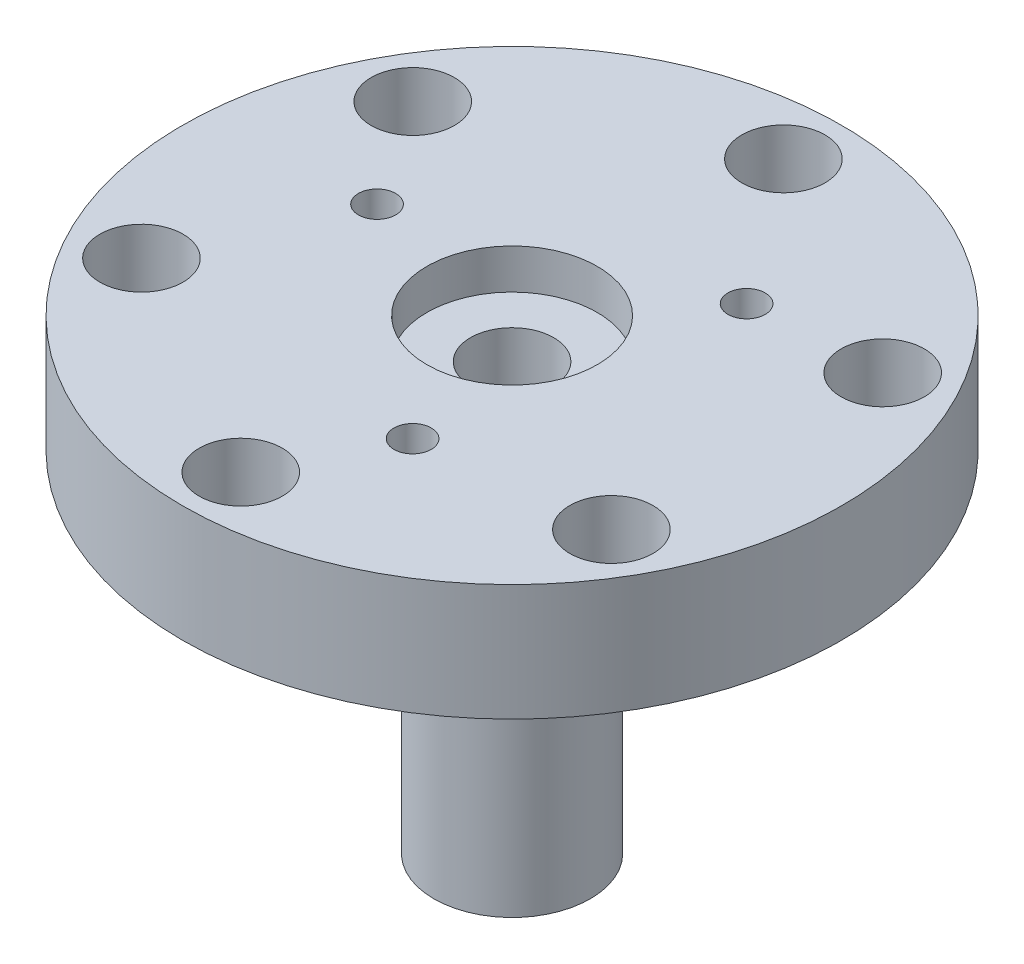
ISO-10303-21;
HEADER;
FILE_DESCRIPTION(('STEP AP214'),'2;1');
FILE_NAME('part.step','',(''),(''),'','','');
FILE_SCHEMA(('AUTOMOTIVE_DESIGN { 1 0 10303 214 1 1 1 1 }'));
ENDSEC;
DATA;
#1=APPLICATION_CONTEXT('core data for automotive mechanical design processes');
#2=APPLICATION_PROTOCOL_DEFINITION('international standard','automotive_design',2000,#1);
#3=PRODUCT_CONTEXT('',#1,'mechanical');
#4=PRODUCT('Part','Part','',(#3));
#5=PRODUCT_RELATED_PRODUCT_CATEGORY('part','',(#4));
#6=PRODUCT_DEFINITION_FORMATION('','',#4);
#7=PRODUCT_DEFINITION_CONTEXT('part definition',#1,'design');
#8=PRODUCT_DEFINITION('design','',#6,#7);
#9=PRODUCT_DEFINITION_SHAPE('','',#8);
#10=(LENGTH_UNIT() NAMED_UNIT(*) SI_UNIT(.MILLI.,.METRE.));
#11=(NAMED_UNIT(*) PLANE_ANGLE_UNIT() SI_UNIT($,.RADIAN.));
#12=(NAMED_UNIT(*) SI_UNIT($,.STERADIAN.) SOLID_ANGLE_UNIT());
#13=UNCERTAINTY_MEASURE_WITH_UNIT(LENGTH_MEASURE(1.E-05),#10,'distance_accuracy_value','');
#14=(GEOMETRIC_REPRESENTATION_CONTEXT(3) GLOBAL_UNCERTAINTY_ASSIGNED_CONTEXT((#13)) GLOBAL_UNIT_ASSIGNED_CONTEXT((#10,
#11,#12)) REPRESENTATION_CONTEXT('',''));
#15=CARTESIAN_POINT('',(0.,0.,0.));
#16=DIRECTION('',(0.,0.,1.));
#17=DIRECTION('',(1.,0.,0.));
#18=AXIS2_PLACEMENT_3D('',#15,#16,#17);
#19=CARTESIAN_POINT('',(17.9275918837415,-35.56,10.3505000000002));
#20=DIRECTION('',(0.,1.,0.));
#21=DIRECTION('',(0.,0.,1.));
#22=AXIS2_PLACEMENT_3D('',#19,#20,#21);
#23=CYLINDRICAL_SURFACE('',#22,1.7272);
#24=CARTESIAN_POINT('',(17.9275918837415,-8.89,10.3505000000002));
#25=DIRECTION('',(0.,-1.,0.));
#26=DIRECTION('',(0.,0.,-1.));
#27=AXIS2_PLACEMENT_3D('',#24,#25,#26);
#28=CIRCLE('',#27,1.7272);
#29=CARTESIAN_POINT('',(17.9275918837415,-8.89,8.62330000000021));
#30=VERTEX_POINT('',#29);
#31=EDGE_CURVE('E57',#30,#30,#28,.T.);
#32=ORIENTED_EDGE('',*,*,#31,.T.);
#33=EDGE_LOOP('',(#32));
#34=FACE_BOUND('',#33,.T.);
#35=CARTESIAN_POINT('',(17.9275918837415,-5.842,10.3505000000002));
#36=DIRECTION('',(0.,1.,0.));
#37=DIRECTION('',(0.,0.,1.));
#38=AXIS2_PLACEMENT_3D('',#35,#36,#37);
#39=CIRCLE('',#38,1.7272);
#40=CARTESIAN_POINT('',(17.9275918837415,-5.842,12.0777000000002));
#41=VERTEX_POINT('',#40);
#42=EDGE_CURVE('E74',#41,#41,#39,.F.);
#43=ORIENTED_EDGE('',*,*,#42,.F.);
#44=EDGE_LOOP('',(#43));
#45=FACE_BOUND('',#44,.T.);
#46=ADVANCED_FACE('F32',(#34,#45),#23,.F.);
#47=CARTESIAN_POINT('',(17.9275918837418,-35.56,-10.3504999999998));
#48=DIRECTION('',(0.,1.,0.));
#49=DIRECTION('',(0.,0.,1.));
#50=AXIS2_PLACEMENT_3D('',#47,#48,#49);
#51=CYLINDRICAL_SURFACE('',#50,1.7272);
#52=CARTESIAN_POINT('',(17.9275918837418,-8.89,-10.3504999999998));
#53=DIRECTION('',(0.,-1.,0.));
#54=DIRECTION('',(0.,0.,-1.));
#55=AXIS2_PLACEMENT_3D('',#52,#53,#54);
#56=CIRCLE('',#55,1.7272);
#57=CARTESIAN_POINT('',(17.9275918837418,-8.89,-12.0776999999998));
#58=VERTEX_POINT('',#57);
#59=EDGE_CURVE('E133',#58,#58,#56,.T.);
#60=ORIENTED_EDGE('',*,*,#59,.T.);
#61=EDGE_LOOP('',(#60));
#62=FACE_BOUND('',#61,.T.);
#63=CARTESIAN_POINT('',(17.9275918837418,-5.842,-10.3504999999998));
#64=DIRECTION('',(0.,1.,0.));
#65=DIRECTION('',(0.,0.,1.));
#66=AXIS2_PLACEMENT_3D('',#63,#64,#65);
#67=CIRCLE('',#66,1.7272);
#68=CARTESIAN_POINT('',(17.9275918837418,-5.842,-8.62329999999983));
#69=VERTEX_POINT('',#68);
#70=EDGE_CURVE('E69',#69,#69,#67,.F.);
#71=ORIENTED_EDGE('',*,*,#70,.F.);
#72=EDGE_LOOP('',(#71));
#73=FACE_BOUND('',#72,.T.);
#74=ADVANCED_FACE('F208',(#62,#73),#51,.F.);
#75=CARTESIAN_POINT('',(1.44554394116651E-13,-35.56,-20.701));
#76=DIRECTION('',(0.,1.,0.));
#77=DIRECTION('',(0.,0.,1.));
#78=AXIS2_PLACEMENT_3D('',#75,#76,#77);
#79=CYLINDRICAL_SURFACE('',#78,1.7272);
#80=CARTESIAN_POINT('',(1.44554394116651E-13,-8.89,-20.701));
#81=DIRECTION('',(0.,-1.,0.));
#82=DIRECTION('',(0.,0.,-1.));
#83=AXIS2_PLACEMENT_3D('',#80,#81,#82);
#84=CIRCLE('',#83,1.7272);
#85=CARTESIAN_POINT('',(1.44554394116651E-13,-8.89,-22.4282));
#86=VERTEX_POINT('',#85);
#87=EDGE_CURVE('E136',#86,#86,#84,.T.);
#88=ORIENTED_EDGE('',*,*,#87,.T.);
#89=EDGE_LOOP('',(#88));
#90=FACE_BOUND('',#89,.T.);
#91=CARTESIAN_POINT('',(1.44554394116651E-13,-5.842,-20.701));
#92=DIRECTION('',(0.,1.,0.));
#93=DIRECTION('',(0.,0.,1.));
#94=AXIS2_PLACEMENT_3D('',#91,#92,#93);
#95=CIRCLE('',#94,1.7272);
#96=CARTESIAN_POINT('',(1.44554394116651E-13,-5.842,-18.9738));
#97=VERTEX_POINT('',#96);
#98=EDGE_CURVE('E64',#97,#97,#95,.F.);
#99=ORIENTED_EDGE('',*,*,#98,.F.);
#100=EDGE_LOOP('',(#99));
#101=FACE_BOUND('',#100,.T.);
#102=ADVANCED_FACE('F214',(#90,#101),#79,.F.);
#103=CARTESIAN_POINT('',(-17.9275918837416,-35.56,-10.3505000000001));
#104=DIRECTION('',(0.,1.,0.));
#105=DIRECTION('',(0.,0.,1.));
#106=AXIS2_PLACEMENT_3D('',#103,#104,#105);
#107=CYLINDRICAL_SURFACE('',#106,1.7272);
#108=CARTESIAN_POINT('',(-17.9275918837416,-8.89,-10.3505000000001));
#109=DIRECTION('',(0.,-1.,0.));
#110=DIRECTION('',(0.,0.,-1.));
#111=AXIS2_PLACEMENT_3D('',#108,#109,#110);
#112=CIRCLE('',#111,1.7272);
#113=CARTESIAN_POINT('',(-17.9275918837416,-8.89,-12.0777000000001));
#114=VERTEX_POINT('',#113);
#115=EDGE_CURVE('E139',#114,#114,#112,.T.);
#116=ORIENTED_EDGE('',*,*,#115,.T.);
#117=EDGE_LOOP('',(#116));
#118=FACE_BOUND('',#117,.T.);
#119=CARTESIAN_POINT('',(-17.9275918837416,-5.842,-10.3505000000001));
#120=DIRECTION('',(0.,1.,0.));
#121=DIRECTION('',(0.,0.,1.));
#122=AXIS2_PLACEMENT_3D('',#119,#120,#121);
#123=CIRCLE('',#122,1.7272);
#124=CARTESIAN_POINT('',(-17.9275918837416,-5.842,-8.62330000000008));
#125=VERTEX_POINT('',#124);
#126=EDGE_CURVE('E59',#125,#125,#123,.F.);
#127=ORIENTED_EDGE('',*,*,#126,.F.);
#128=EDGE_LOOP('',(#127));
#129=FACE_BOUND('',#128,.T.);
#130=ADVANCED_FACE('F224',(#118,#129),#107,.F.);
#131=CARTESIAN_POINT('',(-17.9275918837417,-35.56,10.3505));
#132=DIRECTION('',(0.,1.,0.));
#133=DIRECTION('',(0.,0.,1.));
#134=AXIS2_PLACEMENT_3D('',#131,#132,#133);
#135=CYLINDRICAL_SURFACE('',#134,1.7272);
#136=CARTESIAN_POINT('',(-17.9275918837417,-8.89,10.3505));
#137=DIRECTION('',(0.,-1.,0.));
#138=DIRECTION('',(0.,0.,-1.));
#139=AXIS2_PLACEMENT_3D('',#136,#137,#138);
#140=CIRCLE('',#139,1.7272);
#141=CARTESIAN_POINT('',(-17.9275918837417,-8.89,8.62329999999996));
#142=VERTEX_POINT('',#141);
#143=EDGE_CURVE('E142',#142,#142,#140,.T.);
#144=ORIENTED_EDGE('',*,*,#143,.T.);
#145=EDGE_LOOP('',(#144));
#146=FACE_BOUND('',#145,.T.);
#147=CARTESIAN_POINT('',(-17.9275918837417,-5.842,10.3505));
#148=DIRECTION('',(0.,1.,0.));
#149=DIRECTION('',(0.,0.,1.));
#150=AXIS2_PLACEMENT_3D('',#147,#148,#149);
#151=CIRCLE('',#150,1.7272);
#152=CARTESIAN_POINT('',(-17.9275918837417,-5.842,12.0777));
#153=VERTEX_POINT('',#152);
#154=EDGE_CURVE('E54',#153,#153,#151,.F.);
#155=ORIENTED_EDGE('',*,*,#154,.F.);
#156=EDGE_LOOP('',(#155));
#157=FACE_BOUND('',#156,.T.);
#158=ADVANCED_FACE('F228',(#146,#157),#135,.F.);
#159=CARTESIAN_POINT('',(0.,-35.56,20.701));
#160=DIRECTION('',(0.,1.,0.));
#161=DIRECTION('',(0.,0.,1.));
#162=AXIS2_PLACEMENT_3D('',#159,#160,#161);
#163=CYLINDRICAL_SURFACE('',#162,1.7272);
#164=CARTESIAN_POINT('',(0.,-8.89,20.701));
#165=DIRECTION('',(0.,-1.,0.));
#166=DIRECTION('',(0.,0.,-1.));
#167=AXIS2_PLACEMENT_3D('',#164,#165,#166);
#168=CIRCLE('',#167,1.7272);
#169=CARTESIAN_POINT('',(0.,-8.89,18.9738));
#170=VERTEX_POINT('',#169);
#171=EDGE_CURVE('E52',#170,#170,#168,.T.);
#172=ORIENTED_EDGE('',*,*,#171,.T.);
#173=EDGE_LOOP('',(#172));
#174=FACE_BOUND('',#173,.T.);
#175=CARTESIAN_POINT('',(0.,-5.842,20.701));
#176=DIRECTION('',(0.,1.,0.));
#177=DIRECTION('',(0.,0.,1.));
#178=AXIS2_PLACEMENT_3D('',#175,#176,#177);
#179=CIRCLE('',#178,1.7272);
#180=CARTESIAN_POINT('',(0.,-5.842,22.4282));
#181=VERTEX_POINT('',#180);
#182=EDGE_CURVE('E49',#181,#181,#179,.F.);
#183=ORIENTED_EDGE('',*,*,#182,.F.);
#184=EDGE_LOOP('',(#183));
#185=FACE_BOUND('',#184,.T.);
#186=ADVANCED_FACE('F232',(#174,#185),#163,.F.);
#187=CARTESIAN_POINT('',(0.,21.2252836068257,0.));
#188=DIRECTION('',(0.,1.,0.));
#189=DIRECTION('',(0.,0.,1.));
#190=AXIS2_PLACEMENT_3D('',#187,#188,#189);
#191=CYLINDRICAL_SURFACE('',#190,6.50239999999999);
#192=CARTESIAN_POINT('',(0.,0.,0.));
#193=DIRECTION('',(0.,1.,0.));
#194=DIRECTION('',(0.,0.,1.));
#195=AXIS2_PLACEMENT_3D('',#192,#193,#194);
#196=CIRCLE('',#195,6.50239999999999);
#197=CARTESIAN_POINT('',(0.,0.,6.50239999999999));
#198=VERTEX_POINT('',#197);
#199=EDGE_CURVE('E152',#198,#198,#196,.T.);
#200=ORIENTED_EDGE('',*,*,#199,.T.);
#201=EDGE_LOOP('',(#200));
#202=FACE_BOUND('',#201,.T.);
#203=CARTESIAN_POINT('',(0.,-3.048,0.));
#204=DIRECTION('',(0.,1.,0.));
#205=DIRECTION('',(0.,0.,1.));
#206=AXIS2_PLACEMENT_3D('',#203,#204,#205);
#207=CIRCLE('',#206,6.50239999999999);
#208=CARTESIAN_POINT('',(0.,-3.048,6.50239999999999));
#209=VERTEX_POINT('',#208);
#210=EDGE_CURVE('E10',#209,#209,#207,.T.);
#211=ORIENTED_EDGE('',*,*,#210,.F.);
#212=EDGE_LOOP('',(#211));
#213=FACE_BOUND('',#212,.T.);
#214=ADVANCED_FACE('F34',(#202,#213),#191,.F.);
#215=CARTESIAN_POINT('',(0.,-3.048,3.17499999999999));
#216=DIRECTION('',(0.,1.,0.));
#217=DIRECTION('',(0.,0.,1.));
#218=AXIS2_PLACEMENT_3D('',#215,#216,#217);
#219=PLANE('',#218);
#220=ORIENTED_EDGE('',*,*,#210,.T.);
#221=EDGE_LOOP('',(#220));
#222=FACE_BOUND('',#221,.T.);
#223=CARTESIAN_POINT('',(0.,-3.048,0.));
#224=DIRECTION('',(0.,1.,0.));
#225=DIRECTION('',(0.,0.,1.));
#226=AXIS2_PLACEMENT_3D('',#223,#224,#225);
#227=CIRCLE('',#226,3.17499999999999);
#228=CARTESIAN_POINT('',(0.,-3.048,3.17499999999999));
#229=VERTEX_POINT('',#228);
#230=EDGE_CURVE('E40',#229,#229,#227,.T.);
#231=ORIENTED_EDGE('',*,*,#230,.F.);
#232=EDGE_LOOP('',(#231));
#233=FACE_BOUND('',#232,.T.);
#234=ADVANCED_FACE('F198',(#222,#233),#219,.T.);
#235=CARTESIAN_POINT('',(0.,21.2252836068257,0.));
#236=DIRECTION('',(0.,1.,0.));
#237=DIRECTION('',(0.,0.,1.));
#238=AXIS2_PLACEMENT_3D('',#235,#236,#237);
#239=CYLINDRICAL_SURFACE('',#238,3.17499999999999);
#240=ORIENTED_EDGE('',*,*,#230,.T.);
#241=EDGE_LOOP('',(#240));
#242=FACE_BOUND('',#241,.T.);
#243=CARTESIAN_POINT('',(0.,-11.938,0.));
#244=DIRECTION('',(0.,1.,0.));
#245=DIRECTION('',(0.,0.,1.));
#246=AXIS2_PLACEMENT_3D('',#243,#244,#245);
#247=CIRCLE('',#246,3.17499999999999);
#248=CARTESIAN_POINT('',(0.,-11.938,3.17499999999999));
#249=VERTEX_POINT('',#248);
#250=EDGE_CURVE('E45',#249,#249,#247,.T.);
#251=ORIENTED_EDGE('',*,*,#250,.F.);
#252=EDGE_LOOP('',(#251));
#253=FACE_BOUND('',#252,.T.);
#254=ADVANCED_FACE('F196',(#242,#253),#239,.F.);
#255=CARTESIAN_POINT('',(0.,-11.938,1.02869999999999));
#256=DIRECTION('',(0.,1.,0.));
#257=DIRECTION('',(0.,0.,1.));
#258=AXIS2_PLACEMENT_3D('',#255,#256,#257);
#259=PLANE('',#258);
#260=ORIENTED_EDGE('',*,*,#250,.T.);
#261=EDGE_LOOP('',(#260));
#262=FACE_BOUND('',#261,.T.);
#263=CARTESIAN_POINT('',(0.,-11.938,0.));
#264=DIRECTION('',(0.,1.,0.));
#265=DIRECTION('',(0.,0.,1.));
#266=AXIS2_PLACEMENT_3D('',#263,#264,#265);
#267=CIRCLE('',#266,1.02869999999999);
#268=CARTESIAN_POINT('',(0.,-11.938,1.02869999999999));
#269=VERTEX_POINT('',#268);
#270=EDGE_CURVE('E188',#269,#269,#267,.T.);
#271=ORIENTED_EDGE('',*,*,#270,.F.);
#272=EDGE_LOOP('',(#271));
#273=FACE_BOUND('',#272,.T.);
#274=ADVANCED_FACE('F193',(#262,#273),#259,.T.);
#275=CARTESIAN_POINT('',(0.,21.2252836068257,0.));
#276=DIRECTION('',(0.,1.,0.));
#277=DIRECTION('',(0.,0.,1.));
#278=AXIS2_PLACEMENT_3D('',#275,#276,#277);
#279=CYLINDRICAL_SURFACE('',#278,1.02869999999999);
#280=ORIENTED_EDGE('',*,*,#270,.T.);
#281=EDGE_LOOP('',(#280));
#282=FACE_BOUND('',#281,.T.);
#283=CARTESIAN_POINT('',(0.,-26.67,0.));
#284=DIRECTION('',(0.,1.,0.));
#285=DIRECTION('',(0.,0.,1.));
#286=AXIS2_PLACEMENT_3D('',#283,#284,#285);
#287=CIRCLE('',#286,1.02869999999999);
#288=CARTESIAN_POINT('',(0.,-26.67,1.02869999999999));
#289=VERTEX_POINT('',#288);
#290=EDGE_CURVE('E185',#289,#289,#287,.T.);
#291=ORIENTED_EDGE('',*,*,#290,.F.);
#292=EDGE_LOOP('',(#291));
#293=FACE_BOUND('',#292,.T.);
#294=ADVANCED_FACE('F205',(#282,#293),#279,.F.);
#295=CARTESIAN_POINT('',(0.,-26.67,3.17499999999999));
#296=DIRECTION('',(0.,-1.,0.));
#297=DIRECTION('',(0.,0.,-1.));
#298=AXIS2_PLACEMENT_3D('',#295,#296,#297);
#299=PLANE('',#298);
#300=ORIENTED_EDGE('',*,*,#290,.T.);
#301=EDGE_LOOP('',(#300));
#302=FACE_BOUND('',#301,.T.);
#303=CARTESIAN_POINT('',(0.,-26.67,0.));
#304=DIRECTION('',(0.,1.,0.));
#305=DIRECTION('',(0.,0.,1.));
#306=AXIS2_PLACEMENT_3D('',#303,#304,#305);
#307=CIRCLE('',#306,3.17499999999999);
#308=CARTESIAN_POINT('',(0.,-26.67,3.17499999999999));
#309=VERTEX_POINT('',#308);
#310=EDGE_CURVE('E182',#309,#309,#307,.T.);
#311=ORIENTED_EDGE('',*,*,#310,.F.);
#312=EDGE_LOOP('',(#311));
#313=FACE_BOUND('',#312,.T.);
#314=ADVANCED_FACE('F285',(#302,#313),#299,.T.);
#315=CARTESIAN_POINT('',(0.,21.2252836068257,0.));
#316=DIRECTION('',(0.,1.,0.));
#317=DIRECTION('',(0.,0.,1.));
#318=AXIS2_PLACEMENT_3D('',#315,#316,#317);
#319=CYLINDRICAL_SURFACE('',#318,3.17499999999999);
#320=ORIENTED_EDGE('',*,*,#310,.T.);
#321=EDGE_LOOP('',(#320));
#322=FACE_BOUND('',#321,.T.);
#323=CARTESIAN_POINT('',(0.,-35.56,0.));
#324=DIRECTION('',(0.,1.,0.));
#325=DIRECTION('',(0.,0.,1.));
#326=AXIS2_PLACEMENT_3D('',#323,#324,#325);
#327=CIRCLE('',#326,3.17499999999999);
#328=CARTESIAN_POINT('',(0.,-35.56,3.17499999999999));
#329=VERTEX_POINT('',#328);
#330=EDGE_CURVE('E179',#329,#329,#327,.T.);
#331=ORIENTED_EDGE('',*,*,#330,.F.);
#332=EDGE_LOOP('',(#331));
#333=FACE_BOUND('',#332,.T.);
#334=ADVANCED_FACE('F281',(#322,#333),#319,.F.);
#335=CARTESIAN_POINT('',(0.,-35.56,5.96899999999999));
#336=DIRECTION('',(0.,-1.,0.));
#337=DIRECTION('',(0.,0.,-1.));
#338=AXIS2_PLACEMENT_3D('',#335,#336,#337);
#339=PLANE('',#338);
#340=ORIENTED_EDGE('',*,*,#330,.T.);
#341=EDGE_LOOP('',(#340));
#342=FACE_BOUND('',#341,.T.);
#343=CARTESIAN_POINT('',(0.,-35.56,0.));
#344=DIRECTION('',(0.,1.,0.));
#345=DIRECTION('',(0.,0.,1.));
#346=AXIS2_PLACEMENT_3D('',#343,#344,#345);
#347=CIRCLE('',#346,5.96899999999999);
#348=CARTESIAN_POINT('',(0.,-35.56,5.96899999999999));
#349=VERTEX_POINT('',#348);
#350=EDGE_CURVE('E176',#349,#349,#347,.T.);
#351=ORIENTED_EDGE('',*,*,#350,.F.);
#352=EDGE_LOOP('',(#351));
#353=FACE_BOUND('',#352,.T.);
#354=ADVANCED_FACE('F277',(#342,#353),#339,.T.);
#355=CARTESIAN_POINT('',(0.,21.2252836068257,0.));
#356=DIRECTION('',(0.,1.,0.));
#357=DIRECTION('',(0.,0.,1.));
#358=AXIS2_PLACEMENT_3D('',#355,#356,#357);
#359=CYLINDRICAL_SURFACE('',#358,5.96899999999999);
#360=ORIENTED_EDGE('',*,*,#350,.T.);
#361=EDGE_LOOP('',(#360));
#362=FACE_BOUND('',#361,.T.);
#363=CARTESIAN_POINT('',(0.,-8.89000000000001,0.));
#364=DIRECTION('',(0.,1.,0.));
#365=DIRECTION('',(0.,0.,1.));
#366=AXIS2_PLACEMENT_3D('',#363,#364,#365);
#367=CIRCLE('',#366,5.96899999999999);
#368=CARTESIAN_POINT('',(0.,-8.89000000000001,5.96899999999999));
#369=VERTEX_POINT('',#368);
#370=EDGE_CURVE('E173',#369,#369,#367,.T.);
#371=ORIENTED_EDGE('',*,*,#370,.F.);
#372=EDGE_LOOP('',(#371));
#373=FACE_BOUND('',#372,.T.);
#374=ADVANCED_FACE('F273',(#362,#373),#359,.T.);
#375=CARTESIAN_POINT('',(0.,-8.89000000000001,8.5852));
#376=DIRECTION('',(0.,-1.,0.));
#377=DIRECTION('',(0.,0.,-1.));
#378=AXIS2_PLACEMENT_3D('',#375,#376,#377);
#379=PLANE('',#378);
#380=ORIENTED_EDGE('',*,*,#370,.T.);
#381=EDGE_LOOP('',(#380));
#382=FACE_BOUND('',#381,.T.);
#383=CARTESIAN_POINT('',(0.,-8.89000000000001,0.));
#384=DIRECTION('',(0.,1.,0.));
#385=DIRECTION('',(0.,0.,1.));
#386=AXIS2_PLACEMENT_3D('',#383,#384,#385);
#387=CIRCLE('',#386,8.5852);
#388=CARTESIAN_POINT('',(0.,-8.89000000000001,8.5852));
#389=VERTEX_POINT('',#388);
#390=EDGE_CURVE('E170',#389,#389,#387,.T.);
#391=ORIENTED_EDGE('',*,*,#390,.F.);
#392=EDGE_LOOP('',(#391));
#393=FACE_BOUND('',#392,.T.);
#394=ADVANCED_FACE('F269',(#382,#393),#379,.T.);
#395=CARTESIAN_POINT('',(0.,21.2252836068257,0.));
#396=DIRECTION('',(0.,1.,0.));
#397=DIRECTION('',(0.,0.,1.));
#398=AXIS2_PLACEMENT_3D('',#395,#396,#397);
#399=CYLINDRICAL_SURFACE('',#398,8.5852);
#400=ORIENTED_EDGE('',*,*,#390,.T.);
#401=EDGE_LOOP('',(#400));
#402=FACE_BOUND('',#401,.T.);
#403=CARTESIAN_POINT('',(0.,-7.62000000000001,0.));
#404=DIRECTION('',(0.,1.,0.));
#405=DIRECTION('',(0.,0.,1.));
#406=AXIS2_PLACEMENT_3D('',#403,#404,#405);
#407=CIRCLE('',#406,8.5852);
#408=CARTESIAN_POINT('',(0.,-7.62000000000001,8.5852));
#409=VERTEX_POINT('',#408);
#410=EDGE_CURVE('E167',#409,#409,#407,.T.);
#411=ORIENTED_EDGE('',*,*,#410,.F.);
#412=EDGE_LOOP('',(#411));
#413=FACE_BOUND('',#412,.T.);
#414=ADVANCED_FACE('F265',(#402,#413),#399,.T.);
#415=CARTESIAN_POINT('',(0.,-7.62000000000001,10.7188));
#416=DIRECTION('',(0.,-1.,0.));
#417=DIRECTION('',(0.,0.,-1.));
#418=AXIS2_PLACEMENT_3D('',#415,#416,#417);
#419=PLANE('',#418);
#420=ORIENTED_EDGE('',*,*,#410,.T.);
#421=EDGE_LOOP('',(#420));
#422=FACE_BOUND('',#421,.T.);
#423=CARTESIAN_POINT('',(0.,-7.62000000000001,0.));
#424=DIRECTION('',(0.,1.,0.));
#425=DIRECTION('',(0.,0.,1.));
#426=AXIS2_PLACEMENT_3D('',#423,#424,#425);
#427=CIRCLE('',#426,10.7188);
#428=CARTESIAN_POINT('',(0.,-7.62000000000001,10.7188));
#429=VERTEX_POINT('',#428);
#430=EDGE_CURVE('E164',#429,#429,#427,.T.);
#431=ORIENTED_EDGE('',*,*,#430,.F.);
#432=EDGE_LOOP('',(#431));
#433=FACE_BOUND('',#432,.T.);
#434=ADVANCED_FACE('F261',(#422,#433),#419,.T.);
#435=CARTESIAN_POINT('',(0.,21.2252836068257,0.));
#436=DIRECTION('',(0.,1.,0.));
#437=DIRECTION('',(0.,0.,1.));
#438=AXIS2_PLACEMENT_3D('',#435,#436,#437);
#439=CYLINDRICAL_SURFACE('',#438,10.7188);
#440=ORIENTED_EDGE('',*,*,#430,.T.);
#441=EDGE_LOOP('',(#440));
#442=FACE_BOUND('',#441,.T.);
#443=CARTESIAN_POINT('',(0.,-8.89000000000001,0.));
#444=DIRECTION('',(0.,1.,0.));
#445=DIRECTION('',(0.,0.,1.));
#446=AXIS2_PLACEMENT_3D('',#443,#444,#445);
#447=CIRCLE('',#446,10.7188);
#448=CARTESIAN_POINT('',(0.,-8.89000000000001,10.7188));
#449=VERTEX_POINT('',#448);
#450=EDGE_CURVE('E161',#449,#449,#447,.T.);
#451=ORIENTED_EDGE('',*,*,#450,.F.);
#452=EDGE_LOOP('',(#451));
#453=FACE_BOUND('',#452,.T.);
#454=ADVANCED_FACE('F257',(#442,#453),#439,.F.);
#455=CARTESIAN_POINT('',(0.,-8.89,25.146));
#456=DIRECTION('',(0.,-1.,0.));
#457=DIRECTION('',(0.,0.,-1.));
#458=AXIS2_PLACEMENT_3D('',#455,#456,#457);
#459=PLANE('',#458);
#460=ORIENTED_EDGE('',*,*,#31,.F.);
#461=EDGE_LOOP('',(#460));
#462=FACE_BOUND('',#461,.T.);
#463=ORIENTED_EDGE('',*,*,#59,.F.);
#464=EDGE_LOOP('',(#463));
#465=FACE_BOUND('',#464,.T.);
#466=ORIENTED_EDGE('',*,*,#87,.F.);
#467=EDGE_LOOP('',(#466));
#468=FACE_BOUND('',#467,.T.);
#469=ORIENTED_EDGE('',*,*,#115,.F.);
#470=EDGE_LOOP('',(#469));
#471=FACE_BOUND('',#470,.T.);
#472=ORIENTED_EDGE('',*,*,#143,.F.);
#473=EDGE_LOOP('',(#472));
#474=FACE_BOUND('',#473,.T.);
#475=ORIENTED_EDGE('',*,*,#171,.F.);
#476=EDGE_LOOP('',(#475));
#477=FACE_BOUND('',#476,.T.);
#478=ORIENTED_EDGE('',*,*,#450,.T.);
#479=EDGE_LOOP('',(#478));
#480=FACE_BOUND('',#479,.T.);
#481=CARTESIAN_POINT('',(0.,-8.89,0.));
#482=DIRECTION('',(0.,1.,0.));
#483=DIRECTION('',(0.,0.,1.));
#484=AXIS2_PLACEMENT_3D('',#481,#482,#483);
#485=CIRCLE('',#484,25.146);
#486=CARTESIAN_POINT('',(0.,-8.89,25.146));
#487=VERTEX_POINT('',#486);
#488=EDGE_CURVE('E158',#487,#487,#485,.T.);
#489=ORIENTED_EDGE('',*,*,#488,.F.);
#490=EDGE_LOOP('',(#489));
#491=FACE_BOUND('',#490,.T.);
#492=ADVANCED_FACE('F253',(#462,#465,#468,#471,#474,#477,#480,#491),#459,.T.);
#493=CARTESIAN_POINT('',(0.,21.2252836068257,0.));
#494=DIRECTION('',(0.,1.,0.));
#495=DIRECTION('',(0.,0.,1.));
#496=AXIS2_PLACEMENT_3D('',#493,#494,#495);
#497=CYLINDRICAL_SURFACE('',#496,25.146);
#498=ORIENTED_EDGE('',*,*,#488,.T.);
#499=EDGE_LOOP('',(#498));
#500=FACE_BOUND('',#499,.T.);
#501=CARTESIAN_POINT('',(0.,0.,0.));
#502=DIRECTION('',(0.,1.,0.));
#503=DIRECTION('',(0.,0.,1.));
#504=AXIS2_PLACEMENT_3D('',#501,#502,#503);
#505=CIRCLE('',#504,25.146);
#506=CARTESIAN_POINT('',(0.,0.,25.146));
#507=VERTEX_POINT('',#506);
#508=EDGE_CURVE('E155',#507,#507,#505,.T.);
#509=ORIENTED_EDGE('',*,*,#508,.F.);
#510=EDGE_LOOP('',(#509));
#511=FACE_BOUND('',#510,.T.);
#512=ADVANCED_FACE('F249',(#500,#511),#497,.T.);
#513=CARTESIAN_POINT('',(0.,0.,6.50239999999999));
#514=DIRECTION('',(0.,1.,0.));
#515=DIRECTION('',(0.,0.,1.));
#516=AXIS2_PLACEMENT_3D('',#513,#514,#515);
#517=PLANE('',#516);
#518=CARTESIAN_POINT('',(-12.507058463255,0.,-2.20533185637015));
#519=DIRECTION('',(0.,1.,0.));
#520=DIRECTION('',(0.866025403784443,0.,-0.499999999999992));
#521=AXIS2_PLACEMENT_3D('',#518,#519,#520);
#522=CIRCLE('',#521,1.4224);
#523=CARTESIAN_POINT('',(-11.275223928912,0.,-2.91653185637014));
#524=VERTEX_POINT('',#523);
#525=EDGE_CURVE('E684',#524,#524,#522,.T.);
#526=ORIENTED_EDGE('',*,*,#525,.F.);
#527=EDGE_LOOP('',(#526));
#528=FACE_BOUND('',#527,.T.);
#529=CARTESIAN_POINT('',(4.34365582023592,0.,11.9340962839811));
#530=DIRECTION('',(0.,1.,0.));
#531=DIRECTION('',(-0.866025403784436,0.,-0.500000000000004));
#532=AXIS2_PLACEMENT_3D('',#529,#530,#531);
#533=CIRCLE('',#532,1.4224);
#534=CARTESIAN_POINT('',(3.11182128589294,0.,11.2228962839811));
#535=VERTEX_POINT('',#534);
#536=EDGE_CURVE('E93',#535,#535,#533,.T.);
#537=ORIENTED_EDGE('',*,*,#536,.F.);
#538=EDGE_LOOP('',(#537));
#539=FACE_BOUND('',#538,.T.);
#540=CARTESIAN_POINT('',(8.16340264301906,0.,-9.72876442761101));
#541=DIRECTION('',(0.,1.,0.));
#542=DIRECTION('',(0.,0.,1.));
#543=AXIS2_PLACEMENT_3D('',#540,#541,#542);
#544=CIRCLE('',#543,1.4224);
#545=CARTESIAN_POINT('',(8.16340264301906,0.,-8.30636442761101));
#546=VERTEX_POINT('',#545);
#547=EDGE_CURVE('E103',#546,#546,#544,.T.);
#548=ORIENTED_EDGE('',*,*,#547,.F.);
#549=EDGE_LOOP('',(#548));
#550=FACE_BOUND('',#549,.T.);
#551=CARTESIAN_POINT('',(17.9275918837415,0.,10.3505000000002));
#552=DIRECTION('',(0.,1.,0.));
#553=DIRECTION('',(0.866025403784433,0.,0.50000000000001));
#554=AXIS2_PLACEMENT_3D('',#551,#552,#553);
#555=CIRCLE('',#554,3.175);
#556=CARTESIAN_POINT('',(20.6772225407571,0.,11.9380000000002));
#557=VERTEX_POINT('',#556);
#558=EDGE_CURVE('E110',#557,#557,#555,.T.);
#559=ORIENTED_EDGE('',*,*,#558,.F.);
#560=EDGE_LOOP('',(#559));
#561=FACE_BOUND('',#560,.T.);
#562=CARTESIAN_POINT('',(17.9275918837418,0.,-10.3504999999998));
#563=DIRECTION('',(0.,1.,0.));
#564=DIRECTION('',(0.866025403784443,0.,-0.499999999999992));
#565=AXIS2_PLACEMENT_3D('',#562,#563,#564);
#566=CIRCLE('',#565,3.175);
#567=CARTESIAN_POINT('',(20.6772225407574,0.,-11.9379999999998));
#568=VERTEX_POINT('',#567);
#569=EDGE_CURVE('E77',#568,#568,#566,.T.);
#570=ORIENTED_EDGE('',*,*,#569,.F.);
#571=EDGE_LOOP('',(#570));
#572=FACE_BOUND('',#571,.T.);
#573=CARTESIAN_POINT('',(1.44554394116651E-13,0.,-20.701));
#574=DIRECTION('',(0.,1.,0.));
#575=DIRECTION('',(0.,0.,-1.));
#576=AXIS2_PLACEMENT_3D('',#573,#574,#575);
#577=CIRCLE('',#576,3.175);
#578=CARTESIAN_POINT('',(1.66725313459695E-13,0.,-23.876));
#579=VERTEX_POINT('',#578);
#580=EDGE_CURVE('E72',#579,#579,#577,.T.);
#581=ORIENTED_EDGE('',*,*,#580,.F.);
#582=EDGE_LOOP('',(#581));
#583=FACE_BOUND('',#582,.T.);
#584=CARTESIAN_POINT('',(-17.9275918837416,0.,-10.3505000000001));
#585=DIRECTION('',(0.,1.,0.));
#586=DIRECTION('',(-0.866025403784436,0.,-0.500000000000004));
#587=AXIS2_PLACEMENT_3D('',#584,#585,#586);
#588=CIRCLE('',#587,3.175);
#589=CARTESIAN_POINT('',(-20.6772225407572,0.,-11.9380000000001));
#590=VERTEX_POINT('',#589);
#591=EDGE_CURVE('E67',#590,#590,#588,.T.);
#592=ORIENTED_EDGE('',*,*,#591,.F.);
#593=EDGE_LOOP('',(#592));
#594=FACE_BOUND('',#593,.T.);
#595=CARTESIAN_POINT('',(-17.9275918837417,0.,10.3505));
#596=DIRECTION('',(0.,1.,0.));
#597=DIRECTION('',(-0.86602540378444,0.,0.499999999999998));
#598=AXIS2_PLACEMENT_3D('',#595,#596,#597);
#599=CIRCLE('',#598,3.175);
#600=CARTESIAN_POINT('',(-20.6772225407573,0.,11.938));
#601=VERTEX_POINT('',#600);
#602=EDGE_CURVE('E62',#601,#601,#599,.T.);
#603=ORIENTED_EDGE('',*,*,#602,.F.);
#604=EDGE_LOOP('',(#603));
#605=FACE_BOUND('',#604,.T.);
#606=CARTESIAN_POINT('',(0.,0.,20.701));
#607=DIRECTION('',(0.,1.,0.));
#608=DIRECTION('',(0.,0.,1.));
#609=AXIS2_PLACEMENT_3D('',#606,#607,#608);
#610=CIRCLE('',#609,3.175);
#611=CARTESIAN_POINT('',(0.,0.,23.876));
#612=VERTEX_POINT('',#611);
#613=EDGE_CURVE('E145',#612,#612,#610,.T.);
#614=ORIENTED_EDGE('',*,*,#613,.F.);
#615=EDGE_LOOP('',(#614));
#616=FACE_BOUND('',#615,.T.);
#617=ORIENTED_EDGE('',*,*,#508,.T.);
#618=EDGE_LOOP('',(#617));
#619=FACE_BOUND('',#618,.T.);
#620=ORIENTED_EDGE('',*,*,#199,.F.);
#621=EDGE_LOOP('',(#620));
#622=FACE_BOUND('',#621,.T.);
#623=ADVANCED_FACE('F238',(#528,#539,#550,#561,#572,#583,#594,#605,#616,#619,#622),#517,.T.);
#624=CARTESIAN_POINT('',(0.,-5.842,20.701));
#625=DIRECTION('',(0.,1.,0.));
#626=DIRECTION('',(0.,0.,1.));
#627=AXIS2_PLACEMENT_3D('',#624,#625,#626);
#628=PLANE('',#627);
#629=CARTESIAN_POINT('',(0.,-5.842,20.701));
#630=DIRECTION('',(0.,1.,0.));
#631=DIRECTION('',(0.,0.,1.));
#632=AXIS2_PLACEMENT_3D('',#629,#630,#631);
#633=CIRCLE('',#632,3.175);
#634=CARTESIAN_POINT('',(0.,-5.842,23.876));
#635=VERTEX_POINT('',#634);
#636=EDGE_CURVE('E53',#635,#635,#633,.T.);
#637=ORIENTED_EDGE('',*,*,#636,.T.);
#638=EDGE_LOOP('',(#637));
#639=FACE_BOUND('',#638,.T.);
#640=ORIENTED_EDGE('',*,*,#182,.T.);
#641=EDGE_LOOP('',(#640));
#642=FACE_BOUND('',#641,.T.);
#643=ADVANCED_FACE('F234',(#639,#642),#628,.T.);
#644=CARTESIAN_POINT('',(0.,-5.842,20.701));
#645=DIRECTION('',(0.,1.,0.));
#646=DIRECTION('',(0.,0.,1.));
#647=AXIS2_PLACEMENT_3D('',#644,#645,#646);
#648=CYLINDRICAL_SURFACE('',#647,3.175);
#649=ORIENTED_EDGE('',*,*,#636,.F.);
#650=EDGE_LOOP('',(#649));
#651=FACE_BOUND('',#650,.T.);
#652=ORIENTED_EDGE('',*,*,#613,.T.);
#653=EDGE_LOOP('',(#652));
#654=FACE_BOUND('',#653,.T.);
#655=ADVANCED_FACE('F237',(#651,#654),#648,.F.);
#656=CARTESIAN_POINT('',(-17.9275918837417,-5.842,10.3505));
#657=DIRECTION('',(0.,1.,0.));
#658=DIRECTION('',(-0.86602540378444,0.,0.499999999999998));
#659=AXIS2_PLACEMENT_3D('',#656,#657,#658);
#660=PLANE('',#659);
#661=CARTESIAN_POINT('',(-17.9275918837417,-5.842,10.3505));
#662=DIRECTION('',(0.,1.,0.));
#663=DIRECTION('',(-0.86602540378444,0.,0.499999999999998));
#664=AXIS2_PLACEMENT_3D('',#661,#662,#663);
#665=CIRCLE('',#664,3.175);
#666=CARTESIAN_POINT('',(-20.6772225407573,-5.842,11.938));
#667=VERTEX_POINT('',#666);
#668=EDGE_CURVE('E58',#667,#667,#665,.T.);
#669=ORIENTED_EDGE('',*,*,#668,.T.);
#670=EDGE_LOOP('',(#669));
#671=FACE_BOUND('',#670,.T.);
#672=ORIENTED_EDGE('',*,*,#154,.T.);
#673=EDGE_LOOP('',(#672));
#674=FACE_BOUND('',#673,.T.);
#675=ADVANCED_FACE('F242',(#671,#674),#660,.T.);
#676=CARTESIAN_POINT('',(-17.9275918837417,-5.842,10.3505));
#677=DIRECTION('',(0.,1.,0.));
#678=DIRECTION('',(0.,0.,1.));
#679=AXIS2_PLACEMENT_3D('',#676,#677,#678);
#680=CYLINDRICAL_SURFACE('',#679,3.175);
#681=ORIENTED_EDGE('',*,*,#668,.F.);
#682=EDGE_LOOP('',(#681));
#683=FACE_BOUND('',#682,.T.);
#684=ORIENTED_EDGE('',*,*,#602,.T.);
#685=EDGE_LOOP('',(#684));
#686=FACE_BOUND('',#685,.T.);
#687=ADVANCED_FACE('F219',(#683,#686),#680,.F.);
#688=CARTESIAN_POINT('',(-17.9275918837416,-5.842,-10.3505000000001));
#689=DIRECTION('',(0.,1.,0.));
#690=DIRECTION('',(-0.866025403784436,0.,-0.500000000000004));
#691=AXIS2_PLACEMENT_3D('',#688,#689,#690);
#692=PLANE('',#691);
#693=CARTESIAN_POINT('',(-17.9275918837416,-5.842,-10.3505000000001));
#694=DIRECTION('',(0.,1.,0.));
#695=DIRECTION('',(-0.866025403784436,0.,-0.500000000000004));
#696=AXIS2_PLACEMENT_3D('',#693,#694,#695);
#697=CIRCLE('',#696,3.175);
#698=CARTESIAN_POINT('',(-20.6772225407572,-5.842,-11.9380000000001));
#699=VERTEX_POINT('',#698);
#700=EDGE_CURVE('E63',#699,#699,#697,.T.);
#701=ORIENTED_EDGE('',*,*,#700,.T.);
#702=EDGE_LOOP('',(#701));
#703=FACE_BOUND('',#702,.T.);
#704=ORIENTED_EDGE('',*,*,#126,.T.);
#705=EDGE_LOOP('',(#704));
#706=FACE_BOUND('',#705,.T.);
#707=ADVANCED_FACE('F470',(#703,#706),#692,.T.);
#708=CARTESIAN_POINT('',(-17.9275918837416,-5.842,-10.3505000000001));
#709=DIRECTION('',(0.,1.,0.));
#710=DIRECTION('',(0.,0.,1.));
#711=AXIS2_PLACEMENT_3D('',#708,#709,#710);
#712=CYLINDRICAL_SURFACE('',#711,3.175);
#713=ORIENTED_EDGE('',*,*,#700,.F.);
#714=EDGE_LOOP('',(#713));
#715=FACE_BOUND('',#714,.T.);
#716=ORIENTED_EDGE('',*,*,#591,.T.);
#717=EDGE_LOOP('',(#716));
#718=FACE_BOUND('',#717,.T.);
#719=ADVANCED_FACE('F479',(#715,#718),#712,.F.);
#720=CARTESIAN_POINT('',(1.44554394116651E-13,-5.842,-20.701));
#721=DIRECTION('',(0.,1.,0.));
#722=DIRECTION('',(0.,0.,-1.));
#723=AXIS2_PLACEMENT_3D('',#720,#721,#722);
#724=PLANE('',#723);
#725=CARTESIAN_POINT('',(1.44554394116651E-13,-5.842,-20.701));
#726=DIRECTION('',(0.,1.,0.));
#727=DIRECTION('',(0.,0.,-1.));
#728=AXIS2_PLACEMENT_3D('',#725,#726,#727);
#729=CIRCLE('',#728,3.175);
#730=CARTESIAN_POINT('',(1.66725313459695E-13,-5.842,-23.876));
#731=VERTEX_POINT('',#730);
#732=EDGE_CURVE('E68',#731,#731,#729,.T.);
#733=ORIENTED_EDGE('',*,*,#732,.T.);
#734=EDGE_LOOP('',(#733));
#735=FACE_BOUND('',#734,.T.);
#736=ORIENTED_EDGE('',*,*,#98,.T.);
#737=EDGE_LOOP('',(#736));
#738=FACE_BOUND('',#737,.T.);
#739=ADVANCED_FACE('F489',(#735,#738),#724,.T.);
#740=CARTESIAN_POINT('',(1.44554394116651E-13,-5.842,-20.701));
#741=DIRECTION('',(0.,1.,0.));
#742=DIRECTION('',(0.,0.,1.));
#743=AXIS2_PLACEMENT_3D('',#740,#741,#742);
#744=CYLINDRICAL_SURFACE('',#743,3.175);
#745=ORIENTED_EDGE('',*,*,#732,.F.);
#746=EDGE_LOOP('',(#745));
#747=FACE_BOUND('',#746,.T.);
#748=ORIENTED_EDGE('',*,*,#580,.T.);
#749=EDGE_LOOP('',(#748));
#750=FACE_BOUND('',#749,.T.);
#751=ADVANCED_FACE('F499',(#747,#750),#744,.F.);
#752=CARTESIAN_POINT('',(17.9275918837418,-5.842,-10.3504999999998));
#753=DIRECTION('',(0.,1.,0.));
#754=DIRECTION('',(0.866025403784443,0.,-0.499999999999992));
#755=AXIS2_PLACEMENT_3D('',#752,#753,#754);
#756=PLANE('',#755);
#757=CARTESIAN_POINT('',(17.9275918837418,-5.842,-10.3504999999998));
#758=DIRECTION('',(0.,1.,0.));
#759=DIRECTION('',(0.866025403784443,0.,-0.499999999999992));
#760=AXIS2_PLACEMENT_3D('',#757,#758,#759);
#761=CIRCLE('',#760,3.175);
#762=CARTESIAN_POINT('',(20.6772225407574,-5.842,-11.9379999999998));
#763=VERTEX_POINT('',#762);
#764=EDGE_CURVE('E73',#763,#763,#761,.T.);
#765=ORIENTED_EDGE('',*,*,#764,.T.);
#766=EDGE_LOOP('',(#765));
#767=FACE_BOUND('',#766,.T.);
#768=ORIENTED_EDGE('',*,*,#70,.T.);
#769=EDGE_LOOP('',(#768));
#770=FACE_BOUND('',#769,.T.);
#771=ADVANCED_FACE('F509',(#767,#770),#756,.T.);
#772=CARTESIAN_POINT('',(17.9275918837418,-5.842,-10.3504999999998));
#773=DIRECTION('',(0.,1.,0.));
#774=DIRECTION('',(0.,0.,1.));
#775=AXIS2_PLACEMENT_3D('',#772,#773,#774);
#776=CYLINDRICAL_SURFACE('',#775,3.175);
#777=ORIENTED_EDGE('',*,*,#764,.F.);
#778=EDGE_LOOP('',(#777));
#779=FACE_BOUND('',#778,.T.);
#780=ORIENTED_EDGE('',*,*,#569,.T.);
#781=EDGE_LOOP('',(#780));
#782=FACE_BOUND('',#781,.T.);
#783=ADVANCED_FACE('F519',(#779,#782),#776,.F.);
#784=CARTESIAN_POINT('',(17.9275918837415,-5.842,10.3505000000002));
#785=DIRECTION('',(0.,1.,0.));
#786=DIRECTION('',(0.866025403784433,0.,0.50000000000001));
#787=AXIS2_PLACEMENT_3D('',#784,#785,#786);
#788=PLANE('',#787);
#789=CARTESIAN_POINT('',(17.9275918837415,-5.842,10.3505000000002));
#790=DIRECTION('',(0.,1.,0.));
#791=DIRECTION('',(0.866025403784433,0.,0.50000000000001));
#792=AXIS2_PLACEMENT_3D('',#789,#790,#791);
#793=CIRCLE('',#792,3.175);
#794=CARTESIAN_POINT('',(20.6772225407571,-5.842,11.9380000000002));
#795=VERTEX_POINT('',#794);
#796=EDGE_CURVE('E78',#795,#795,#793,.T.);
#797=ORIENTED_EDGE('',*,*,#796,.T.);
#798=EDGE_LOOP('',(#797));
#799=FACE_BOUND('',#798,.T.);
#800=ORIENTED_EDGE('',*,*,#42,.T.);
#801=EDGE_LOOP('',(#800));
#802=FACE_BOUND('',#801,.T.);
#803=ADVANCED_FACE('F529',(#799,#802),#788,.T.);
#804=CARTESIAN_POINT('',(17.9275918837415,-5.842,10.3505000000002));
#805=DIRECTION('',(0.,1.,0.));
#806=DIRECTION('',(0.,0.,1.));
#807=AXIS2_PLACEMENT_3D('',#804,#805,#806);
#808=CYLINDRICAL_SURFACE('',#807,3.175);
#809=ORIENTED_EDGE('',*,*,#796,.F.);
#810=EDGE_LOOP('',(#809));
#811=FACE_BOUND('',#810,.T.);
#812=ORIENTED_EDGE('',*,*,#558,.T.);
#813=EDGE_LOOP('',(#812));
#814=FACE_BOUND('',#813,.T.);
#815=ADVANCED_FACE('F539',(#811,#814),#808,.F.);
#816=CARTESIAN_POINT('',(8.16340264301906,-4.064,-9.72876442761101));
#817=DIRECTION('',(0.,1.,0.));
#818=DIRECTION('',(0.,0.,1.));
#819=AXIS2_PLACEMENT_3D('',#816,#817,#818);
#820=PLANE('',#819);
#821=CARTESIAN_POINT('',(8.16340264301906,-4.064,-9.72876442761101));
#822=DIRECTION('',(0.,1.,0.));
#823=DIRECTION('',(0.,0.,1.));
#824=AXIS2_PLACEMENT_3D('',#821,#822,#823);
#825=CIRCLE('',#824,1.4224);
#826=CARTESIAN_POINT('',(8.16340264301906,-4.064,-8.30636442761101));
#827=VERTEX_POINT('',#826);
#828=EDGE_CURVE('E82',#827,#827,#825,.T.);
#829=ORIENTED_EDGE('',*,*,#828,.T.);
#830=EDGE_LOOP('',(#829));
#831=FACE_BOUND('',#830,.T.);
#832=CARTESIAN_POINT('',(8.16340264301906,-4.064,-9.72876442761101));
#833=DIRECTION('',(0.,1.,0.));
#834=DIRECTION('',(0.,0.,1.));
#835=AXIS2_PLACEMENT_3D('',#832,#833,#834);
#836=CIRCLE('',#835,1.1303);
#837=CARTESIAN_POINT('',(8.16340264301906,-4.064,-8.59846442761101));
#838=VERTEX_POINT('',#837);
#839=EDGE_CURVE('E79',#838,#838,#836,.F.);
#840=ORIENTED_EDGE('',*,*,#839,.T.);
#841=EDGE_LOOP('',(#840));
#842=FACE_BOUND('',#841,.T.);
#843=ADVANCED_FACE('F549',(#831,#842),#820,.T.);
#844=CARTESIAN_POINT('',(8.16340264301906,-4.064,-9.72876442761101));
#845=DIRECTION('',(0.,1.,0.));
#846=DIRECTION('',(0.,0.,1.));
#847=AXIS2_PLACEMENT_3D('',#844,#845,#846);
#848=CYLINDRICAL_SURFACE('',#847,1.4224);
#849=ORIENTED_EDGE('',*,*,#828,.F.);
#850=EDGE_LOOP('',(#849));
#851=FACE_BOUND('',#850,.T.);
#852=ORIENTED_EDGE('',*,*,#547,.T.);
#853=EDGE_LOOP('',(#852));
#854=FACE_BOUND('',#853,.T.);
#855=ADVANCED_FACE('F562',(#851,#854),#848,.F.);
#856=CARTESIAN_POINT('',(8.16340264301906,-5.334,-9.72876442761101));
#857=DIRECTION('',(0.,1.,0.));
#858=DIRECTION('',(0.,0.,1.));
#859=AXIS2_PLACEMENT_3D('',#856,#857,#858);
#860=PLANE('',#859);
#861=CARTESIAN_POINT('',(8.16340264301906,-5.334,-9.72876442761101));
#862=DIRECTION('',(0.,1.,0.));
#863=DIRECTION('',(0.,0.,1.));
#864=AXIS2_PLACEMENT_3D('',#861,#862,#863);
#865=CIRCLE('',#864,1.1303);
#866=CARTESIAN_POINT('',(8.16340264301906,-5.334,-8.59846442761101));
#867=VERTEX_POINT('',#866);
#868=EDGE_CURVE('E81',#867,#867,#865,.T.);
#869=ORIENTED_EDGE('',*,*,#868,.T.);
#870=EDGE_LOOP('',(#869));
#871=FACE_BOUND('',#870,.T.);
#872=ADVANCED_FACE('F557',(#871),#860,.T.);
#873=CARTESIAN_POINT('',(8.16340264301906,-5.334,-9.72876442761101));
#874=DIRECTION('',(0.,1.,0.));
#875=DIRECTION('',(0.,0.,1.));
#876=AXIS2_PLACEMENT_3D('',#873,#874,#875);
#877=CYLINDRICAL_SURFACE('',#876,1.1303);
#878=ORIENTED_EDGE('',*,*,#868,.F.);
#879=EDGE_LOOP('',(#878));
#880=FACE_BOUND('',#879,.T.);
#881=ORIENTED_EDGE('',*,*,#839,.F.);
#882=EDGE_LOOP('',(#881));
#883=FACE_BOUND('',#882,.T.);
#884=ADVANCED_FACE('F561',(#880,#883),#877,.F.);
#885=CARTESIAN_POINT('',(4.34365582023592,-4.064,11.9340962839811));
#886=DIRECTION('',(0.,1.,0.));
#887=DIRECTION('',(-0.866025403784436,0.,-0.500000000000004));
#888=AXIS2_PLACEMENT_3D('',#885,#886,#887);
#889=PLANE('',#888);
#890=CARTESIAN_POINT('',(4.34365582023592,-4.064,11.9340962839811));
#891=DIRECTION('',(0.,1.,0.));
#892=DIRECTION('',(-0.866025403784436,0.,-0.500000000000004));
#893=AXIS2_PLACEMENT_3D('',#890,#891,#892);
#894=CIRCLE('',#893,1.4224);
#895=CARTESIAN_POINT('',(3.11182128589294,-4.064,11.2228962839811));
#896=VERTEX_POINT('',#895);
#897=EDGE_CURVE('E86',#896,#896,#894,.T.);
#898=ORIENTED_EDGE('',*,*,#897,.T.);
#899=EDGE_LOOP('',(#898));
#900=FACE_BOUND('',#899,.T.);
#901=CARTESIAN_POINT('',(4.34365582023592,-4.064,11.9340962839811));
#902=DIRECTION('',(0.,1.,0.));
#903=DIRECTION('',(0.,0.,1.));
#904=AXIS2_PLACEMENT_3D('',#901,#902,#903);
#905=CIRCLE('',#904,1.1303);
#906=CARTESIAN_POINT('',(4.34365582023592,-4.064,13.0643962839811));
#907=VERTEX_POINT('',#906);
#908=EDGE_CURVE('E83',#907,#907,#905,.F.);
#909=ORIENTED_EDGE('',*,*,#908,.T.);
#910=EDGE_LOOP('',(#909));
#911=FACE_BOUND('',#910,.T.);
#912=ADVANCED_FACE('F590',(#900,#911),#889,.T.);
#913=CARTESIAN_POINT('',(4.34365582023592,-4.064,11.9340962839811));
#914=DIRECTION('',(0.,1.,0.));
#915=DIRECTION('',(0.,0.,1.));
#916=AXIS2_PLACEMENT_3D('',#913,#914,#915);
#917=CYLINDRICAL_SURFACE('',#916,1.4224);
#918=ORIENTED_EDGE('',*,*,#897,.F.);
#919=EDGE_LOOP('',(#918));
#920=FACE_BOUND('',#919,.T.);
#921=ORIENTED_EDGE('',*,*,#536,.T.);
#922=EDGE_LOOP('',(#921));
#923=FACE_BOUND('',#922,.T.);
#924=ADVANCED_FACE('F605',(#920,#923),#917,.F.);
#925=CARTESIAN_POINT('',(4.34365582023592,-5.334,11.9340962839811));
#926=DIRECTION('',(0.,1.,0.));
#927=DIRECTION('',(-0.866025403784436,0.,-0.500000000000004));
#928=AXIS2_PLACEMENT_3D('',#925,#926,#927);
#929=PLANE('',#928);
#930=CARTESIAN_POINT('',(4.34365582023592,-5.334,11.9340962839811));
#931=DIRECTION('',(0.,1.,0.));
#932=DIRECTION('',(-0.866025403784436,0.,-0.500000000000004));
#933=AXIS2_PLACEMENT_3D('',#930,#931,#932);
#934=CIRCLE('',#933,1.1303);
#935=CARTESIAN_POINT('',(3.36478730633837,-5.334,11.3689462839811));
#936=VERTEX_POINT('',#935);
#937=EDGE_CURVE('E90',#936,#936,#934,.T.);
#938=ORIENTED_EDGE('',*,*,#937,.T.);
#939=EDGE_LOOP('',(#938));
#940=FACE_BOUND('',#939,.T.);
#941=ADVANCED_FACE('F615',(#940),#929,.T.);
#942=CARTESIAN_POINT('',(4.34365582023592,-5.334,11.9340962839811));
#943=DIRECTION('',(0.,1.,0.));
#944=DIRECTION('',(0.,0.,1.));
#945=AXIS2_PLACEMENT_3D('',#942,#943,#944);
#946=CYLINDRICAL_SURFACE('',#945,1.1303);
#947=ORIENTED_EDGE('',*,*,#937,.F.);
#948=EDGE_LOOP('',(#947));
#949=FACE_BOUND('',#948,.T.);
#950=ORIENTED_EDGE('',*,*,#908,.F.);
#951=EDGE_LOOP('',(#950));
#952=FACE_BOUND('',#951,.T.);
#953=ADVANCED_FACE('F625',(#949,#952),#946,.F.);
#954=CARTESIAN_POINT('',(-12.507058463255,-4.064,-2.20533185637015));
#955=DIRECTION('',(0.,1.,0.));
#956=DIRECTION('',(0.866025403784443,0.,-0.499999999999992));
#957=AXIS2_PLACEMENT_3D('',#954,#955,#956);
#958=PLANE('',#957);
#959=CARTESIAN_POINT('',(-12.507058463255,-4.064,-2.20533185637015));
#960=DIRECTION('',(0.,1.,0.));
#961=DIRECTION('',(0.866025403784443,0.,-0.499999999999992));
#962=AXIS2_PLACEMENT_3D('',#959,#960,#961);
#963=CIRCLE('',#962,1.4224);
#964=CARTESIAN_POINT('',(-11.275223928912,-4.064,-2.91653185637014));
#965=VERTEX_POINT('',#964);
#966=EDGE_CURVE('E682',#965,#965,#963,.T.);
#967=ORIENTED_EDGE('',*,*,#966,.T.);
#968=EDGE_LOOP('',(#967));
#969=FACE_BOUND('',#968,.T.);
#970=CARTESIAN_POINT('',(-12.507058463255,-4.064,-2.20533185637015));
#971=DIRECTION('',(0.,1.,0.));
#972=DIRECTION('',(0.,0.,1.));
#973=AXIS2_PLACEMENT_3D('',#970,#971,#972);
#974=CIRCLE('',#973,1.1303);
#975=CARTESIAN_POINT('',(-12.507058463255,-4.064,-1.07503185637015));
#976=VERTEX_POINT('',#975);
#977=EDGE_CURVE('E36',#976,#976,#974,.F.);
#978=ORIENTED_EDGE('',*,*,#977,.T.);
#979=EDGE_LOOP('',(#978));
#980=FACE_BOUND('',#979,.T.);
#981=ADVANCED_FACE('F636',(#969,#980),#958,.T.);
#982=CARTESIAN_POINT('',(-12.507058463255,-4.064,-2.20533185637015));
#983=DIRECTION('',(0.,1.,0.));
#984=DIRECTION('',(0.,0.,1.));
#985=AXIS2_PLACEMENT_3D('',#982,#983,#984);
#986=CYLINDRICAL_SURFACE('',#985,1.4224);
#987=ORIENTED_EDGE('',*,*,#966,.F.);
#988=EDGE_LOOP('',(#987));
#989=FACE_BOUND('',#988,.T.);
#990=ORIENTED_EDGE('',*,*,#525,.T.);
#991=EDGE_LOOP('',(#990));
#992=FACE_BOUND('',#991,.T.);
#993=ADVANCED_FACE('F645',(#989,#992),#986,.F.);
#994=CARTESIAN_POINT('',(-12.507058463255,-5.334,-2.20533185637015));
#995=DIRECTION('',(0.,1.,0.));
#996=DIRECTION('',(0.866025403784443,0.,-0.499999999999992));
#997=AXIS2_PLACEMENT_3D('',#994,#995,#996);
#998=PLANE('',#997);
#999=CARTESIAN_POINT('',(-12.507058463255,-5.334,-2.20533185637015));
#1000=DIRECTION('',(0.,1.,0.));
#1001=DIRECTION('',(0.866025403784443,0.,-0.499999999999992));
#1002=AXIS2_PLACEMENT_3D('',#999,#1000,#1001);
#1003=CIRCLE('',#1002,1.1303);
#1004=CARTESIAN_POINT('',(-11.5281899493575,-5.334,-2.77048185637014));
#1005=VERTEX_POINT('',#1004);
#1006=EDGE_CURVE('E85',#1005,#1005,#1003,.T.);
#1007=ORIENTED_EDGE('',*,*,#1006,.T.);
#1008=EDGE_LOOP('',(#1007));
#1009=FACE_BOUND('',#1008,.T.);
#1010=ADVANCED_FACE('F655',(#1009),#998,.T.);
#1011=CARTESIAN_POINT('',(-12.507058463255,-5.334,-2.20533185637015));
#1012=DIRECTION('',(0.,1.,0.));
#1013=DIRECTION('',(0.,0.,1.));
#1014=AXIS2_PLACEMENT_3D('',#1011,#1012,#1013);
#1015=CYLINDRICAL_SURFACE('',#1014,1.1303);
#1016=ORIENTED_EDGE('',*,*,#1006,.F.);
#1017=EDGE_LOOP('',(#1016));
#1018=FACE_BOUND('',#1017,.T.);
#1019=ORIENTED_EDGE('',*,*,#977,.F.);
#1020=EDGE_LOOP('',(#1019));
#1021=FACE_BOUND('',#1020,.T.);
#1022=ADVANCED_FACE('F664',(#1018,#1021),#1015,.F.);
#1023=CLOSED_SHELL('',(#46,#74,#102,#130,#158,#186,#214,#234,#254,#274,#294,#314,#334,#354,#374,
#394,#414,#434,#454,#492,#512,#623,#643,#655,#675,#687,#707,#719,#739,#751,#771,#783,#803,#815,
#843,#855,#872,#884,#912,#924,#941,#953,#981,#993,#1010,#1022));
#1024=MANIFOLD_SOLID_BREP('B2',#1023);
#1025=ADVANCED_BREP_SHAPE_REPRESENTATION('',(#18,#1024),#14);
#1026=SHAPE_DEFINITION_REPRESENTATION(#9,#1025);
ENDSEC;
END-ISO-10303-21;
